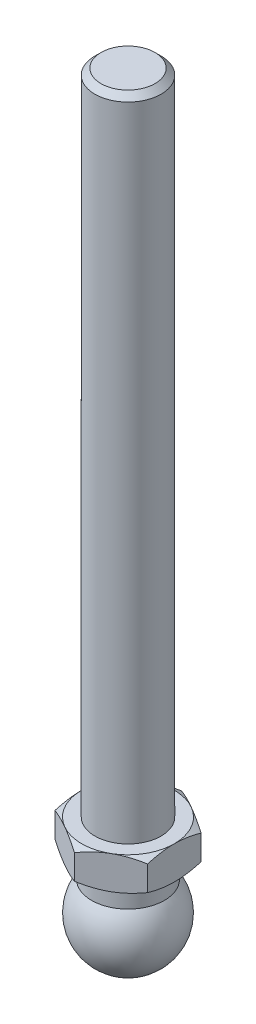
ISO-10303-21;
HEADER;
FILE_DESCRIPTION(('STEP AP214'),'2;1');
FILE_NAME('part.step','',(''),(''),'','','');
FILE_SCHEMA(('AUTOMOTIVE_DESIGN { 1 0 10303 214 1 1 1 1 }'));
ENDSEC;
DATA;
#1=APPLICATION_CONTEXT('core data for automotive mechanical design processes');
#2=APPLICATION_PROTOCOL_DEFINITION('international standard','automotive_design',2000,#1);
#3=PRODUCT_CONTEXT('',#1,'mechanical');
#4=PRODUCT('Part','Part','',(#3));
#5=PRODUCT_RELATED_PRODUCT_CATEGORY('part','',(#4));
#6=PRODUCT_DEFINITION_FORMATION('','',#4);
#7=PRODUCT_DEFINITION_CONTEXT('part definition',#1,'design');
#8=PRODUCT_DEFINITION('design','',#6,#7);
#9=PRODUCT_DEFINITION_SHAPE('','',#8);
#10=(LENGTH_UNIT() NAMED_UNIT(*) SI_UNIT(.MILLI.,.METRE.));
#11=(NAMED_UNIT(*) PLANE_ANGLE_UNIT() SI_UNIT($,.RADIAN.));
#12=(NAMED_UNIT(*) SI_UNIT($,.STERADIAN.) SOLID_ANGLE_UNIT());
#13=UNCERTAINTY_MEASURE_WITH_UNIT(LENGTH_MEASURE(1.E-05),#10,'distance_accuracy_value','');
#14=(GEOMETRIC_REPRESENTATION_CONTEXT(3) GLOBAL_UNCERTAINTY_ASSIGNED_CONTEXT((#13)) GLOBAL_UNIT_ASSIGNED_CONTEXT((#10,
#11,#12)) REPRESENTATION_CONTEXT('',''));
#15=CARTESIAN_POINT('',(0.,0.,0.));
#16=DIRECTION('',(0.,0.,1.));
#17=DIRECTION('',(1.,0.,0.));
#18=AXIS2_PLACEMENT_3D('',#15,#16,#17);
#19=CARTESIAN_POINT('',(0.,19.5,0.));
#20=DIRECTION('',(0.,-1.,0.));
#21=DIRECTION('',(0.,0.,-1.));
#22=AXIS2_PLACEMENT_3D('',#19,#20,#21);
#23=CONICAL_SURFACE('',#22,7.,1.0471975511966);
#24=CARTESIAN_POINT('',(-7.,15.2688336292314,12.5023453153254));
#25=CARTESIAN_POINT('',(-7.,15.4184696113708,12.2052647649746));
#26=CARTESIAN_POINT('',(-7.,15.5671267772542,11.9076861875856));
#27=CARTESIAN_POINT('',(-7.,15.8620076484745,11.3113035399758));
#28=CARTESIAN_POINT('',(-7.,16.0082312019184,11.0124993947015));
#29=CARTESIAN_POINT('',(-7.,16.2980281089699,10.4128982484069));
#30=CARTESIAN_POINT('',(-7.,16.441595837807,10.1120985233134));
#31=CARTESIAN_POINT('',(-7.,16.7251296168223,9.50881013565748));
#32=CARTESIAN_POINT('',(-7.,16.8650957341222,9.20632150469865));
#33=CARTESIAN_POINT('',(-7.,17.1470427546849,8.58510325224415));
#34=CARTESIAN_POINT('',(-7.,17.2888108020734,8.26627671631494));
#35=CARTESIAN_POINT('',(-7.,17.5662200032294,7.62594250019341));
#36=CARTESIAN_POINT('',(-7.,17.7018608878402,7.30443470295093));
#37=CARTESIAN_POINT('',(-7.,17.9652496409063,6.65840905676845));
#38=CARTESIAN_POINT('',(-7.,18.0930022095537,6.33389313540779));
#39=CARTESIAN_POINT('',(-7.,18.3384540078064,5.68109770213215));
#40=CARTESIAN_POINT('',(-7.,18.4561543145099,5.35281859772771));
#41=CARTESIAN_POINT('',(-7.,18.7028165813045,4.61998548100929));
#42=CARTESIAN_POINT('',(-7.,18.8286623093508,4.21436746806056));
#43=CARTESIAN_POINT('',(-7.,19.0543524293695,3.39574912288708));
#44=CARTESIAN_POINT('',(-7.,19.1541980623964,2.98274914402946));
#45=CARTESIAN_POINT('',(-7.,19.2776062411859,2.36178861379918));
#46=CARTESIAN_POINT('',(-7.,19.3141378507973,2.15638627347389));
#47=CARTESIAN_POINT('',(-7.,19.3780104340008,1.74416917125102));
#48=CARTESIAN_POINT('',(-7.,19.4053527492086,1.53735462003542));
#49=CARTESIAN_POINT('',(-7.,19.4500375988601,1.1227076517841));
#50=CARTESIAN_POINT('',(-7.,19.467383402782,0.914875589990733));
#51=CARTESIAN_POINT('',(-7.,19.4915250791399,0.498594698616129));
#52=CARTESIAN_POINT('',(-7.,19.4983210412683,0.290145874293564));
#53=CARTESIAN_POINT('',(-7.,19.5011397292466,-0.128421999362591));
#54=CARTESIAN_POINT('',(-7.,19.4970795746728,-0.338541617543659));
#55=CARTESIAN_POINT('',(-7.,19.4781521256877,-0.758289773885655));
#56=CARTESIAN_POINT('',(-7.,19.463284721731,-0.967918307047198));
#57=CARTESIAN_POINT('',(-7.,19.4232345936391,-1.38625975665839));
#58=CARTESIAN_POINT('',(-7.,19.3980479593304,-1.59497229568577));
#59=CARTESIAN_POINT('',(-7.,19.3381380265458,-2.01100790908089));
#60=CARTESIAN_POINT('',(-7.,19.3034145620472,-2.21833095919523));
#61=CARTESIAN_POINT('',(-7.,19.1849408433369,-2.84522045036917));
#62=CARTESIAN_POINT('',(-7.,19.0876569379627,-3.26225118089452));
#63=CARTESIAN_POINT('',(-7.,18.8658468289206,-4.08879182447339));
#64=CARTESIAN_POINT('',(-7.,18.7413180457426,-4.4983010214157));
#65=CARTESIAN_POINT('',(-7.,18.4953846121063,-5.2406101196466));
#66=CARTESIAN_POINT('',(-7.,18.3771372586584,-5.5744719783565));
#67=CARTESIAN_POINT('',(-7.,18.1300009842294,-6.23825206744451));
#68=CARTESIAN_POINT('',(-7.,18.0011107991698,-6.56816982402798));
#69=CARTESIAN_POINT('',(-7.,17.7350197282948,-7.22486424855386));
#70=CARTESIAN_POINT('',(-7.,17.5978135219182,-7.55163874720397));
#71=CARTESIAN_POINT('',(-7.,17.3169731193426,-8.20238370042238));
#72=CARTESIAN_POINT('',(-7.,17.1733392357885,-8.5263542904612));
#73=CARTESIAN_POINT('',(-7.,16.8876445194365,-9.15729037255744));
#74=CARTESIAN_POINT('',(-7.,16.7458097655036,-9.46435857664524));
#75=CARTESIAN_POINT('',(-7.,16.4583976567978,-10.0767426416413));
#76=CARTESIAN_POINT('',(-7.,16.3128202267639,-10.3820584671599));
#77=CARTESIAN_POINT('',(-7.,16.018926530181,-10.990585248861));
#78=CARTESIAN_POINT('',(-7.,15.8706165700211,-11.2937992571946));
#79=CARTESIAN_POINT('',(-7.,15.5714843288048,-11.8989613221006));
#80=CARTESIAN_POINT('',(-7.,15.4206622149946,-12.2009094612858));
#81=CARTESIAN_POINT('',(-7.,15.2688336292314,-12.5023453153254));
#82=B_SPLINE_CURVE_WITH_KNOTS('',3,(#24,#25,#26,#27,#28,#29,#30,#31,#32,#33,#34,#35,#36,#37,#38,
#39,#40,#41,#42,#43,#44,#45,#46,#47,#48,#49,#50,#51,#52,#53,#54,#55,#56,#57,#58,#59,#60,#61,#62,
#63,#64,#65,#66,#67,#68,#69,#70,#71,#72,#73,#74,#75,#76,#77,#78,#79,#80,#81),.UNSPECIFIED.,.F.,
.F.,(4,2,2,2,2,2,2,2,2,2,2,2,2,2,2,2,2,2,2,2,2,2,2,2,2,2,2,2,4),(0.,0.997917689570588,
1.99589743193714,2.99579247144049,3.99566886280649,5.04239250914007,6.08916209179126,
7.13530182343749,8.18132932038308,9.45480706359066,10.7282240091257,11.3539282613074,
11.9795411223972,12.6049492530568,13.2303520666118,13.8605430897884,14.490740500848,
15.1211769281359,15.7516243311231,17.0349275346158,18.3183522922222,19.380686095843,
20.4431462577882,21.506293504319,22.5693890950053,23.5840866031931,24.5988045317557,
25.6114179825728,26.6239642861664),.UNSPECIFIED.);
#83=CARTESIAN_POINT('',(-7.,18.8747852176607,4.04145188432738));
#84=VERTEX_POINT('',#83);
#85=CARTESIAN_POINT('',(-7.,19.5,0.));
#86=VERTEX_POINT('',#85);
#87=EDGE_CURVE('E358',#84,#86,#82,.T.);
#88=ORIENTED_EDGE('',*,*,#87,.F.);
#89=CARTESIAN_POINT('',(0.0002,18.8747185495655,8.0830192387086));
#90=CARTESIAN_POINT('',(-0.153667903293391,18.9260001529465,7.99418356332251));
#91=CARTESIAN_POINT('',(-0.30810950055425,18.9749544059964,7.90501666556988));
#92=CARTESIAN_POINT('',(-0.618246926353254,19.0675672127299,7.72595873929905));
#93=CARTESIAN_POINT('',(-0.773943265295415,19.1112234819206,7.63606741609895));
#94=CARTESIAN_POINT('',(-1.24352516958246,19.2333884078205,7.36495417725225));
#95=CARTESIAN_POINT('',(-1.5592643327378,19.302874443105,7.18266208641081));
#96=CARTESIAN_POINT('',(-2.03176224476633,19.3843550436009,6.9098652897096));
#97=CARTESIAN_POINT('',(-2.18710922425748,19.4075665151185,6.82017566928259));
#98=CARTESIAN_POINT('',(-2.49850511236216,19.4464887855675,6.64039116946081));
#99=CARTESIAN_POINT('',(-2.65455395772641,19.4622002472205,6.55029632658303));
#100=CARTESIAN_POINT('',(-2.96692267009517,19.4857220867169,6.36995016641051));
#101=CARTESIAN_POINT('',(-3.12324202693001,19.4935414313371,6.27969914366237));
#102=CARTESIAN_POINT('',(-3.43601650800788,19.5011197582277,6.09911871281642));
#103=CARTESIAN_POINT('',(-3.59247162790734,19.500878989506,6.00878930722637));
#104=CARTESIAN_POINT('',(-4.02110687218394,19.4891402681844,5.76131663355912));
#105=CARTESIAN_POINT('',(-4.2931466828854,19.4694342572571,5.60425437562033));
#106=CARTESIAN_POINT('',(-4.83541944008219,19.4069465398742,5.29117305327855));
#107=CARTESIAN_POINT('',(-5.10565047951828,19.364143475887,5.13515508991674));
#108=CARTESIAN_POINT('',(-5.64901454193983,19.2571483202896,4.82144370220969));
#109=CARTESIAN_POINT('',(-5.92207900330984,19.1925029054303,4.66378986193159));
#110=CARTESIAN_POINT('',(-6.46413578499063,19.045783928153,4.35083323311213));
#111=CARTESIAN_POINT('',(-6.73313504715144,18.9637448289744,4.19552643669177));
#112=CARTESIAN_POINT('',(-7.0002,18.8747185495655,4.04133641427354));
#113=B_SPLINE_CURVE_WITH_KNOTS('',3,(#89,#90,#91,#92,#93,#94,#95,#96,#97,#98,#99,#100,#101,#102,
#103,#104,#105,#106,#107,#108,#109,#110,#111,#112),.UNSPECIFIED.,.F.,.F.,(4,2,2,2,2,2,2,2,2,2,2,
4),(0.,0.554727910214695,1.10969417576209,2.2219327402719,2.76443041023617,3.30688013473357,
3.8487128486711,4.39052882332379,5.33376515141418,6.27787517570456,7.2429241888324,
8.20607866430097),.UNSPECIFIED.);
#114=CARTESIAN_POINT('',(-3.5,19.5,6.06217782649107));
#115=VERTEX_POINT('',#114);
#116=EDGE_CURVE('E147',#115,#84,#113,.T.);
#117=ORIENTED_EDGE('',*,*,#116,.F.);
#118=CARTESIAN_POINT('',(0.,19.5,0.));
#119=DIRECTION('',(0.,-1.,0.));
#120=DIRECTION('',(0.,0.,-1.));
#121=AXIS2_PLACEMENT_3D('',#118,#119,#120);
#122=CIRCLE('',#121,7.);
#123=EDGE_CURVE('E316',#115,#86,#122,.T.);
#124=ORIENTED_EDGE('',*,*,#123,.T.);
#125=EDGE_LOOP('',(#88,#117,#124));
#126=FACE_BOUND('',#125,.T.);
#127=ADVANCED_FACE('F17',(#126),#23,.T.);
#128=CARTESIAN_POINT('',(-7.,18.8747852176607,-4.04145188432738));
#129=VERTEX_POINT('',#128);
#130=EDGE_CURVE('E212',#86,#129,#82,.T.);
#131=ORIENTED_EDGE('',*,*,#130,.F.);
#132=CARTESIAN_POINT('',(-3.5,19.5,-6.06217782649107));
#133=VERTEX_POINT('',#132);
#134=EDGE_CURVE('E339',#86,#133,#122,.T.);
#135=ORIENTED_EDGE('',*,*,#134,.T.);
#136=CARTESIAN_POINT('',(-7.0002,18.8747185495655,-4.04133641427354));
#137=CARTESIAN_POINT('',(-6.84633209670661,18.9260001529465,-4.13017208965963));
#138=CARTESIAN_POINT('',(-6.69189049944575,18.9749544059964,-4.21933898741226));
#139=CARTESIAN_POINT('',(-6.38175307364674,19.0675672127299,-4.39839691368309));
#140=CARTESIAN_POINT('',(-6.22605673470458,19.1112234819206,-4.48828823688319));
#141=CARTESIAN_POINT('',(-5.75647483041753,19.2333884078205,-4.75940147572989));
#142=CARTESIAN_POINT('',(-5.4407356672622,19.302874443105,-4.94169356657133));
#143=CARTESIAN_POINT('',(-4.96823775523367,19.3843550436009,-5.21449036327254));
#144=CARTESIAN_POINT('',(-4.81289077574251,19.4075665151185,-5.30417998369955));
#145=CARTESIAN_POINT('',(-4.50149488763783,19.4464887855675,-5.48396448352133));
#146=CARTESIAN_POINT('',(-4.34544604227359,19.4622002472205,-5.57405932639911));
#147=CARTESIAN_POINT('',(-4.03307732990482,19.4857220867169,-5.75440548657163));
#148=CARTESIAN_POINT('',(-3.87675797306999,19.4935414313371,-5.84465650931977));
#149=CARTESIAN_POINT('',(-3.56398349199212,19.5011197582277,-6.02523694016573));
#150=CARTESIAN_POINT('',(-3.40752837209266,19.500878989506,-6.11556634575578));
#151=CARTESIAN_POINT('',(-2.97889312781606,19.4891402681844,-6.36303901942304));
#152=CARTESIAN_POINT('',(-2.7068533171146,19.4694342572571,-6.52010127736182));
#153=CARTESIAN_POINT('',(-2.1645805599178,19.4069465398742,-6.83318259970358));
#154=CARTESIAN_POINT('',(-1.89434952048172,19.364143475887,-6.9892005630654));
#155=CARTESIAN_POINT('',(-1.35098545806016,19.2571483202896,-7.30291195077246));
#156=CARTESIAN_POINT('',(-1.07792099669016,19.1925029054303,-7.46056579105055));
#157=CARTESIAN_POINT('',(-0.53586421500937,19.045783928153,-7.77352241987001));
#158=CARTESIAN_POINT('',(-0.26686495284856,18.9637448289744,-7.92882921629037));
#159=CARTESIAN_POINT('',(0.000200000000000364,18.8747185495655,-8.0830192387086));
#160=B_SPLINE_CURVE_WITH_KNOTS('',3,(#136,#137,#138,#139,#140,#141,#142,#143,#144,#145,#146,
#147,#148,#149,#150,#151,#152,#153,#154,#155,#156,#157,#158,#159),.UNSPECIFIED.,.F.,.F.,(4,2,2,
2,2,2,2,2,2,2,2,4),(0.,0.554727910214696,1.10969417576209,2.2219327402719,2.76443041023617,
3.30688013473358,3.8487128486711,4.39052882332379,5.33376515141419,6.27787517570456,
7.2429241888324,8.20607866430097),.UNSPECIFIED.);
#161=EDGE_CURVE('E204',#129,#133,#160,.T.);
#162=ORIENTED_EDGE('',*,*,#161,.F.);
#163=EDGE_LOOP('',(#131,#135,#162));
#164=FACE_BOUND('',#163,.T.);
#165=ADVANCED_FACE('F405',(#164),#23,.T.);
#166=CARTESIAN_POINT('',(0.,18.8747852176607,-8.08290376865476));
#167=VERTEX_POINT('',#166);
#168=EDGE_CURVE('E205',#133,#167,#160,.T.);
#169=ORIENTED_EDGE('',*,*,#168,.F.);
#170=CARTESIAN_POINT('',(3.5,19.5,-6.06217782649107));
#171=VERTEX_POINT('',#170);
#172=EDGE_CURVE('E330',#133,#171,#122,.T.);
#173=ORIENTED_EDGE('',*,*,#172,.T.);
#174=CARTESIAN_POINT('',(-0.0002,18.8747185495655,-8.0830192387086));
#175=CARTESIAN_POINT('',(0.153667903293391,18.9260001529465,-7.99418356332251));
#176=CARTESIAN_POINT('',(0.30810950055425,18.9749544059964,-7.90501666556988));
#177=CARTESIAN_POINT('',(0.618246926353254,19.0675672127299,-7.72595873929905));
#178=CARTESIAN_POINT('',(0.773943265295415,19.1112234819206,-7.63606741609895));
#179=CARTESIAN_POINT('',(1.24352516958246,19.2333884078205,-7.36495417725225));
#180=CARTESIAN_POINT('',(1.5592643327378,19.302874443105,-7.18266208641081));
#181=CARTESIAN_POINT('',(2.03176224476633,19.3843550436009,-6.9098652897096));
#182=CARTESIAN_POINT('',(2.18710922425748,19.4075665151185,-6.82017566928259));
#183=CARTESIAN_POINT('',(2.49850511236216,19.4464887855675,-6.64039116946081));
#184=CARTESIAN_POINT('',(2.65455395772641,19.4622002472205,-6.55029632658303));
#185=CARTESIAN_POINT('',(2.96692267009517,19.4857220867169,-6.36995016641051));
#186=CARTESIAN_POINT('',(3.12324202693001,19.4935414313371,-6.27969914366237));
#187=CARTESIAN_POINT('',(3.43601650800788,19.5011197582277,-6.09911871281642));
#188=CARTESIAN_POINT('',(3.59247162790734,19.500878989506,-6.00878930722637));
#189=CARTESIAN_POINT('',(4.02110687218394,19.4891402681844,-5.76131663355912));
#190=CARTESIAN_POINT('',(4.2931466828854,19.4694342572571,-5.60425437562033));
#191=CARTESIAN_POINT('',(4.83541944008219,19.4069465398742,-5.29117305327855));
#192=CARTESIAN_POINT('',(5.10565047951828,19.364143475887,-5.13515508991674));
#193=CARTESIAN_POINT('',(5.64901454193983,19.2571483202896,-4.82144370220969));
#194=CARTESIAN_POINT('',(5.92207900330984,19.1925029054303,-4.66378986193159));
#195=CARTESIAN_POINT('',(6.46413578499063,19.045783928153,-4.35083323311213));
#196=CARTESIAN_POINT('',(6.73313504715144,18.9637448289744,-4.19552643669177));
#197=CARTESIAN_POINT('',(7.0002,18.8747185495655,-4.04133641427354));
#198=B_SPLINE_CURVE_WITH_KNOTS('',3,(#174,#175,#176,#177,#178,#179,#180,#181,#182,#183,#184,
#185,#186,#187,#188,#189,#190,#191,#192,#193,#194,#195,#196,#197),.UNSPECIFIED.,.F.,.F.,(4,2,2,
2,2,2,2,2,2,2,2,4),(0.,0.554727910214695,1.10969417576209,2.2219327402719,2.76443041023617,
3.30688013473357,3.8487128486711,4.39052882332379,5.33376515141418,6.27787517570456,
7.2429241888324,8.20607866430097),.UNSPECIFIED.);
#199=EDGE_CURVE('E246',#167,#171,#198,.T.);
#200=ORIENTED_EDGE('',*,*,#199,.F.);
#201=EDGE_LOOP('',(#169,#173,#200));
#202=FACE_BOUND('',#201,.T.);
#203=ADVANCED_FACE('F411',(#202),#23,.T.);
#204=CARTESIAN_POINT('',(7.,18.8747852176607,-4.04145188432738));
#205=VERTEX_POINT('',#204);
#206=EDGE_CURVE('E247',#171,#205,#198,.T.);
#207=ORIENTED_EDGE('',*,*,#206,.F.);
#208=CARTESIAN_POINT('',(7.,19.5,0.));
#209=VERTEX_POINT('',#208);
#210=EDGE_CURVE('E323',#171,#209,#122,.T.);
#211=ORIENTED_EDGE('',*,*,#210,.T.);
#212=CARTESIAN_POINT('',(7.,15.2688336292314,-12.5023453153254));
#213=CARTESIAN_POINT('',(7.,15.4184696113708,-12.2052647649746));
#214=CARTESIAN_POINT('',(7.,15.5671267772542,-11.9076861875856));
#215=CARTESIAN_POINT('',(7.,15.8620076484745,-11.3113035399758));
#216=CARTESIAN_POINT('',(7.,16.0082312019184,-11.0124993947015));
#217=CARTESIAN_POINT('',(7.,16.2980281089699,-10.4128982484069));
#218=CARTESIAN_POINT('',(7.,16.441595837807,-10.1120985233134));
#219=CARTESIAN_POINT('',(7.,16.7251296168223,-9.50881013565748));
#220=CARTESIAN_POINT('',(7.,16.8650957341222,-9.20632150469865));
#221=CARTESIAN_POINT('',(7.,17.1470427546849,-8.58510325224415));
#222=CARTESIAN_POINT('',(7.,17.2888108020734,-8.26627671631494));
#223=CARTESIAN_POINT('',(7.,17.5662200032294,-7.62594250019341));
#224=CARTESIAN_POINT('',(7.,17.7018608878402,-7.30443470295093));
#225=CARTESIAN_POINT('',(7.,17.9652496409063,-6.65840905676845));
#226=CARTESIAN_POINT('',(7.,18.0930022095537,-6.33389313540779));
#227=CARTESIAN_POINT('',(7.,18.3384540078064,-5.68109770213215));
#228=CARTESIAN_POINT('',(7.,18.4561543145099,-5.35281859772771));
#229=CARTESIAN_POINT('',(7.,18.7028165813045,-4.61998548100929));
#230=CARTESIAN_POINT('',(7.,18.8286623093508,-4.21436746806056));
#231=CARTESIAN_POINT('',(7.,19.0543524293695,-3.39574912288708));
#232=CARTESIAN_POINT('',(7.,19.1541980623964,-2.98274914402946));
#233=CARTESIAN_POINT('',(7.,19.2776062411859,-2.36178861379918));
#234=CARTESIAN_POINT('',(7.,19.3141378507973,-2.15638627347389));
#235=CARTESIAN_POINT('',(7.,19.3780104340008,-1.74416917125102));
#236=CARTESIAN_POINT('',(7.,19.4053527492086,-1.53735462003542));
#237=CARTESIAN_POINT('',(7.,19.4500375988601,-1.1227076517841));
#238=CARTESIAN_POINT('',(7.,19.467383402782,-0.914875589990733));
#239=CARTESIAN_POINT('',(7.,19.4915250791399,-0.498594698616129));
#240=CARTESIAN_POINT('',(7.,19.4983210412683,-0.290145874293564));
#241=CARTESIAN_POINT('',(7.,19.5011397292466,0.128421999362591));
#242=CARTESIAN_POINT('',(7.,19.4970795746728,0.338541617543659));
#243=CARTESIAN_POINT('',(7.,19.4781521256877,0.758289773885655));
#244=CARTESIAN_POINT('',(7.,19.463284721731,0.967918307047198));
#245=CARTESIAN_POINT('',(7.,19.4232345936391,1.38625975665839));
#246=CARTESIAN_POINT('',(7.,19.3980479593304,1.59497229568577));
#247=CARTESIAN_POINT('',(7.,19.3381380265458,2.01100790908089));
#248=CARTESIAN_POINT('',(7.,19.3034145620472,2.21833095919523));
#249=CARTESIAN_POINT('',(7.,19.1849408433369,2.84522045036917));
#250=CARTESIAN_POINT('',(7.,19.0876569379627,3.26225118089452));
#251=CARTESIAN_POINT('',(7.,18.8658468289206,4.08879182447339));
#252=CARTESIAN_POINT('',(7.,18.7413180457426,4.4983010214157));
#253=CARTESIAN_POINT('',(7.,18.4953846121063,5.2406101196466));
#254=CARTESIAN_POINT('',(7.,18.3771372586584,5.5744719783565));
#255=CARTESIAN_POINT('',(7.,18.1300009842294,6.23825206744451));
#256=CARTESIAN_POINT('',(7.,18.0011107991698,6.56816982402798));
#257=CARTESIAN_POINT('',(7.,17.7350197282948,7.22486424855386));
#258=CARTESIAN_POINT('',(7.,17.5978135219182,7.55163874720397));
#259=CARTESIAN_POINT('',(7.,17.3169731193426,8.20238370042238));
#260=CARTESIAN_POINT('',(7.,17.1733392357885,8.5263542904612));
#261=CARTESIAN_POINT('',(7.,16.8876445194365,9.15729037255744));
#262=CARTESIAN_POINT('',(7.,16.7458097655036,9.46435857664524));
#263=CARTESIAN_POINT('',(7.,16.4583976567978,10.0767426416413));
#264=CARTESIAN_POINT('',(7.,16.3128202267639,10.3820584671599));
#265=CARTESIAN_POINT('',(7.,16.018926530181,10.990585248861));
#266=CARTESIAN_POINT('',(7.,15.8706165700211,11.2937992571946));
#267=CARTESIAN_POINT('',(7.,15.5714843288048,11.8989613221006));
#268=CARTESIAN_POINT('',(7.,15.4206622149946,12.2009094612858));
#269=CARTESIAN_POINT('',(7.,15.2688336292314,12.5023453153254));
#270=B_SPLINE_CURVE_WITH_KNOTS('',3,(#212,#213,#214,#215,#216,#217,#218,#219,#220,#221,#222,
#223,#224,#225,#226,#227,#228,#229,#230,#231,#232,#233,#234,#235,#236,#237,#238,#239,#240,#241,
#242,#243,#244,#245,#246,#247,#248,#249,#250,#251,#252,#253,#254,#255,#256,#257,#258,#259,#260,
#261,#262,#263,#264,#265,#266,#267,#268,#269),.UNSPECIFIED.,.F.,.F.,(4,2,2,2,2,2,2,2,2,2,2,2,2,
2,2,2,2,2,2,2,2,2,2,2,2,2,2,2,4),(0.,0.997917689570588,1.99589743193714,2.99579247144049,
3.99566886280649,5.04239250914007,6.08916209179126,7.13530182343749,8.18132932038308,
9.45480706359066,10.7282240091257,11.3539282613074,11.9795411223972,12.6049492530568,
13.2303520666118,13.8605430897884,14.490740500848,15.1211769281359,15.7516243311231,
17.0349275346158,18.3183522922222,19.380686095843,20.4431462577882,21.506293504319,
22.5693890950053,23.5840866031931,24.5988045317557,25.6114179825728,26.6239642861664),.UNSPECIFIED.);
#271=EDGE_CURVE('E269',#205,#209,#270,.T.);
#272=ORIENTED_EDGE('',*,*,#271,.F.);
#273=EDGE_LOOP('',(#207,#211,#272));
#274=FACE_BOUND('',#273,.T.);
#275=ADVANCED_FACE('F421',(#274),#23,.T.);
#276=CARTESIAN_POINT('',(7.,18.8747852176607,4.04145188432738));
#277=VERTEX_POINT('',#276);
#278=EDGE_CURVE('E270',#209,#277,#270,.T.);
#279=ORIENTED_EDGE('',*,*,#278,.F.);
#280=CARTESIAN_POINT('',(3.5,19.5,6.06217782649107));
#281=VERTEX_POINT('',#280);
#282=EDGE_CURVE('E313',#209,#281,#122,.T.);
#283=ORIENTED_EDGE('',*,*,#282,.T.);
#284=CARTESIAN_POINT('',(7.0002,18.8747185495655,4.04133641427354));
#285=CARTESIAN_POINT('',(6.84633209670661,18.9260001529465,4.13017208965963));
#286=CARTESIAN_POINT('',(6.69189049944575,18.9749544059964,4.21933898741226));
#287=CARTESIAN_POINT('',(6.38175307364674,19.0675672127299,4.39839691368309));
#288=CARTESIAN_POINT('',(6.22605673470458,19.1112234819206,4.48828823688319));
#289=CARTESIAN_POINT('',(5.75647483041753,19.2333884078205,4.75940147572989));
#290=CARTESIAN_POINT('',(5.4407356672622,19.302874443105,4.94169356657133));
#291=CARTESIAN_POINT('',(4.96823775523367,19.3843550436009,5.21449036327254));
#292=CARTESIAN_POINT('',(4.81289077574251,19.4075665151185,5.30417998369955));
#293=CARTESIAN_POINT('',(4.50149488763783,19.4464887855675,5.48396448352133));
#294=CARTESIAN_POINT('',(4.34544604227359,19.4622002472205,5.57405932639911));
#295=CARTESIAN_POINT('',(4.03307732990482,19.4857220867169,5.75440548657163));
#296=CARTESIAN_POINT('',(3.87675797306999,19.4935414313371,5.84465650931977));
#297=CARTESIAN_POINT('',(3.56398349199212,19.5011197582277,6.02523694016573));
#298=CARTESIAN_POINT('',(3.40752837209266,19.500878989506,6.11556634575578));
#299=CARTESIAN_POINT('',(2.97889312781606,19.4891402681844,6.36303901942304));
#300=CARTESIAN_POINT('',(2.7068533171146,19.4694342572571,6.52010127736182));
#301=CARTESIAN_POINT('',(2.1645805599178,19.4069465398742,6.83318259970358));
#302=CARTESIAN_POINT('',(1.89434952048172,19.364143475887,6.9892005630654));
#303=CARTESIAN_POINT('',(1.35098545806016,19.2571483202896,7.30291195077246));
#304=CARTESIAN_POINT('',(1.07792099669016,19.1925029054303,7.46056579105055));
#305=CARTESIAN_POINT('',(0.53586421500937,19.045783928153,7.77352241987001));
#306=CARTESIAN_POINT('',(0.26686495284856,18.9637448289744,7.92882921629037));
#307=CARTESIAN_POINT('',(-0.000200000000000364,18.8747185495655,8.0830192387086));
#308=B_SPLINE_CURVE_WITH_KNOTS('',3,(#284,#285,#286,#287,#288,#289,#290,#291,#292,#293,#294,
#295,#296,#297,#298,#299,#300,#301,#302,#303,#304,#305,#306,#307),.UNSPECIFIED.,.F.,.F.,(4,2,2,
2,2,2,2,2,2,2,2,4),(0.,0.554727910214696,1.10969417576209,2.2219327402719,2.76443041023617,
3.30688013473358,3.8487128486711,4.39052882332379,5.33376515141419,6.27787517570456,
7.2429241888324,8.20607866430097),.UNSPECIFIED.);
#309=EDGE_CURVE('E137',#277,#281,#308,.T.);
#310=ORIENTED_EDGE('',*,*,#309,.F.);
#311=EDGE_LOOP('',(#279,#283,#310));
#312=FACE_BOUND('',#311,.T.);
#313=ADVANCED_FACE('F319',(#312),#23,.T.);
#314=CARTESIAN_POINT('',(0.,18.8747852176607,8.08290376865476));
#315=VERTEX_POINT('',#314);
#316=EDGE_CURVE('E121',#281,#315,#308,.T.);
#317=ORIENTED_EDGE('',*,*,#316,.F.);
#318=EDGE_CURVE('E308',#281,#115,#122,.T.);
#319=ORIENTED_EDGE('',*,*,#318,.T.);
#320=EDGE_CURVE('E33',#315,#115,#113,.T.);
#321=ORIENTED_EDGE('',*,*,#320,.F.);
#322=EDGE_LOOP('',(#317,#319,#321));
#323=FACE_BOUND('',#322,.T.);
#324=ADVANCED_FACE('F307',(#323),#23,.T.);
#325=CARTESIAN_POINT('',(5.,19.5,0.));
#326=DIRECTION('',(0.,-1.,0.));
#327=DIRECTION('',(0.,0.,-1.));
#328=AXIS2_PLACEMENT_3D('',#325,#326,#327);
#329=PLANE('',#328);
#330=CARTESIAN_POINT('',(0.,19.5,0.));
#331=DIRECTION('',(0.,-1.,0.));
#332=DIRECTION('',(0.,0.,-1.));
#333=AXIS2_PLACEMENT_3D('',#330,#331,#332);
#334=CIRCLE('',#333,5.);
#335=CARTESIAN_POINT('',(0.,19.5,-5.));
#336=VERTEX_POINT('',#335);
#337=EDGE_CURVE('E322',#336,#336,#334,.F.);
#338=ORIENTED_EDGE('',*,*,#337,.F.);
#339=EDGE_LOOP('',(#338));
#340=FACE_BOUND('',#339,.T.);
#341=ORIENTED_EDGE('',*,*,#282,.F.);
#342=ORIENTED_EDGE('',*,*,#210,.F.);
#343=ORIENTED_EDGE('',*,*,#172,.F.);
#344=ORIENTED_EDGE('',*,*,#134,.F.);
#345=ORIENTED_EDGE('',*,*,#123,.F.);
#346=ORIENTED_EDGE('',*,*,#318,.F.);
#347=EDGE_LOOP('',(#341,#342,#343,#344,#345,#346));
#348=FACE_BOUND('',#347,.T.);
#349=ADVANCED_FACE('F226',(#340,#348),#329,.F.);
#350=CARTESIAN_POINT('',(-7.,14.3,-4.04145188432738));
#351=DIRECTION('',(-1.,0.,0.));
#352=DIRECTION('',(0.,0.,1.));
#353=AXIS2_PLACEMENT_3D('',#350,#351,#352);
#354=PLANE('',#353);
#355=ORIENTED_EDGE('',*,*,#87,.T.);
#356=ORIENTED_EDGE('',*,*,#130,.T.);
#357=DIRECTION('',(0.,1.,0.));
#358=VECTOR('',#357,1.);
#359=CARTESIAN_POINT('',(-7.,14.3,-4.04145188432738));
#360=LINE('',#359,#358);
#361=CARTESIAN_POINT('',(-7.,15.1252147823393,-4.04145188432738));
#362=VERTEX_POINT('',#361);
#363=EDGE_CURVE('E114',#362,#129,#360,.T.);
#364=ORIENTED_EDGE('',*,*,#363,.F.);
#365=CARTESIAN_POINT('',(-7.,18.7311663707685,-12.5023453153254));
#366=CARTESIAN_POINT('',(-7.,18.5815303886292,-12.2052647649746));
#367=CARTESIAN_POINT('',(-7.,18.4328732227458,-11.9076861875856));
#368=CARTESIAN_POINT('',(-7.,18.1379923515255,-11.3113035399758));
#369=CARTESIAN_POINT('',(-7.,17.9917687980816,-11.0124993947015));
#370=CARTESIAN_POINT('',(-7.,17.7019718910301,-10.4128982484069));
#371=CARTESIAN_POINT('',(-7.,17.558404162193,-10.1120985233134));
#372=CARTESIAN_POINT('',(-7.,17.2748703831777,-9.50881013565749));
#373=CARTESIAN_POINT('',(-7.,17.1349042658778,-9.20632150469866));
#374=CARTESIAN_POINT('',(-7.,16.8529572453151,-8.58510325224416));
#375=CARTESIAN_POINT('',(-7.,16.7111891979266,-8.26627671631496));
#376=CARTESIAN_POINT('',(-7.,16.4337799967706,-7.62594250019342));
#377=CARTESIAN_POINT('',(-7.,16.2981391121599,-7.30443470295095));
#378=CARTESIAN_POINT('',(-7.,16.0347503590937,-6.65840905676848));
#379=CARTESIAN_POINT('',(-7.,15.9069977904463,-6.33389313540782));
#380=CARTESIAN_POINT('',(-7.,15.6615459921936,-5.68109770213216));
#381=CARTESIAN_POINT('',(-7.,15.5438456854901,-5.35281859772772));
#382=CARTESIAN_POINT('',(-7.,15.2971834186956,-4.6199854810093));
#383=CARTESIAN_POINT('',(-7.,15.1713376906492,-4.21436746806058));
#384=CARTESIAN_POINT('',(-7.,14.9456475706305,-3.39574912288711));
#385=CARTESIAN_POINT('',(-7.,14.8458019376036,-2.98274914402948));
#386=CARTESIAN_POINT('',(-7.,14.7223937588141,-2.3617886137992));
#387=CARTESIAN_POINT('',(-7.,14.6858621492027,-2.1563862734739));
#388=CARTESIAN_POINT('',(-7.,14.6219895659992,-1.74416917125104));
#389=CARTESIAN_POINT('',(-7.,14.5946472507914,-1.53735462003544));
#390=CARTESIAN_POINT('',(-7.,14.5499624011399,-1.12270765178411));
#391=CARTESIAN_POINT('',(-7.,14.532616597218,-0.914875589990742));
#392=CARTESIAN_POINT('',(-7.,14.5084749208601,-0.498594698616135));
#393=CARTESIAN_POINT('',(-7.,14.5016789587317,-0.290145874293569));
#394=CARTESIAN_POINT('',(-7.,14.4988602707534,0.128421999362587));
#395=CARTESIAN_POINT('',(-7.,14.5029204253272,0.338541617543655));
#396=CARTESIAN_POINT('',(-7.,14.5218478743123,0.758289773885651));
#397=CARTESIAN_POINT('',(-7.,14.5367152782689,0.967918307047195));
#398=CARTESIAN_POINT('',(-7.,14.5767654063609,1.38625975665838));
#399=CARTESIAN_POINT('',(-7.,14.6019520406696,1.59497229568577));
#400=CARTESIAN_POINT('',(-7.,14.6618619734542,2.01100790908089));
#401=CARTESIAN_POINT('',(-7.,14.6965854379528,2.21833095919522));
#402=CARTESIAN_POINT('',(-7.,14.8150591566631,2.84522045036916));
#403=CARTESIAN_POINT('',(-7.,14.9123430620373,3.26225118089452));
#404=CARTESIAN_POINT('',(-7.,15.1341531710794,4.08879182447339));
#405=CARTESIAN_POINT('',(-7.,15.2586819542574,4.4983010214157));
#406=CARTESIAN_POINT('',(-7.,15.5046153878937,5.2406101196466));
#407=CARTESIAN_POINT('',(-7.,15.6228627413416,5.5744719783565));
#408=CARTESIAN_POINT('',(-7.,15.8699990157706,6.23825206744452));
#409=CARTESIAN_POINT('',(-7.,15.9988892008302,6.56816982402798));
#410=CARTESIAN_POINT('',(-7.,16.2649802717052,7.22486424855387));
#411=CARTESIAN_POINT('',(-7.,16.4021864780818,7.55163874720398));
#412=CARTESIAN_POINT('',(-7.,16.6830268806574,8.20238370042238));
#413=CARTESIAN_POINT('',(-7.,16.8266607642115,8.5263542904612));
#414=CARTESIAN_POINT('',(-7.,17.1123554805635,9.15729037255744));
#415=CARTESIAN_POINT('',(-7.,17.2541902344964,9.46435857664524));
#416=CARTESIAN_POINT('',(-7.,17.5416023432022,10.0767426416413));
#417=CARTESIAN_POINT('',(-7.,17.6871797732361,10.38205846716));
#418=CARTESIAN_POINT('',(-7.,17.981073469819,10.990585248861));
#419=CARTESIAN_POINT('',(-7.,18.1293834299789,11.2937992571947));
#420=CARTESIAN_POINT('',(-7.,18.4285156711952,11.8989613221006));
#421=CARTESIAN_POINT('',(-7.,18.5793377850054,12.2009094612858));
#422=CARTESIAN_POINT('',(-7.,18.7311663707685,12.5023453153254));
#423=B_SPLINE_CURVE_WITH_KNOTS('',3,(#365,#366,#367,#368,#369,#370,#371,#372,#373,#374,#375,
#376,#377,#378,#379,#380,#381,#382,#383,#384,#385,#386,#387,#388,#389,#390,#391,#392,#393,#394,
#395,#396,#397,#398,#399,#400,#401,#402,#403,#404,#405,#406,#407,#408,#409,#410,#411,#412,#413,
#414,#415,#416,#417,#418,#419,#420,#421,#422),.UNSPECIFIED.,.F.,.F.,(4,2,2,2,2,2,2,2,2,2,2,2,2,
2,2,2,2,2,2,2,2,2,2,2,2,2,2,2,4),(0.,0.997917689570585,1.99589743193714,2.99579247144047,
3.99566886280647,5.04239250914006,6.08916209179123,7.13530182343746,8.18132932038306,
9.45480706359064,10.7282240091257,11.3539282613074,11.9795411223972,12.6049492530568,
13.2303520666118,13.8605430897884,14.490740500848,15.1211769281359,15.7516243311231,
17.0349275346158,18.3183522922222,19.380686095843,20.4431462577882,21.506293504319,
22.5693890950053,23.5840866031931,24.5988045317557,25.6114179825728,26.6239642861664),.UNSPECIFIED.);
#424=CARTESIAN_POINT('',(-7.,14.5,0.));
#425=VERTEX_POINT('',#424);
#426=EDGE_CURVE('E203',#362,#425,#423,.T.);
#427=ORIENTED_EDGE('',*,*,#426,.T.);
#428=CARTESIAN_POINT('',(-7.,15.1252147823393,4.04145188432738));
#429=VERTEX_POINT('',#428);
#430=EDGE_CURVE('E193',#425,#429,#423,.T.);
#431=ORIENTED_EDGE('',*,*,#430,.T.);
#432=DIRECTION('',(0.,1.,0.));
#433=VECTOR('',#432,1.);
#434=CARTESIAN_POINT('',(-7.,14.3,4.04145188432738));
#435=LINE('',#434,#433);
#436=EDGE_CURVE('E124',#429,#84,#435,.T.);
#437=ORIENTED_EDGE('',*,*,#436,.T.);
#438=EDGE_LOOP('',(#355,#356,#364,#427,#431,#437));
#439=FACE_BOUND('',#438,.T.);
#440=ADVANCED_FACE('F221',(#439),#354,.T.);
#441=CARTESIAN_POINT('',(0.,14.3,-8.08290376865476));
#442=DIRECTION('',(-0.5,0.,-0.866025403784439));
#443=DIRECTION('',(-0.866025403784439,0.,0.5));
#444=AXIS2_PLACEMENT_3D('',#441,#442,#443);
#445=PLANE('',#444);
#446=ORIENTED_EDGE('',*,*,#161,.T.);
#447=ORIENTED_EDGE('',*,*,#168,.T.);
#448=DIRECTION('',(0.,1.,0.));
#449=VECTOR('',#448,1.);
#450=CARTESIAN_POINT('',(0.,14.3,-8.08290376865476));
#451=LINE('',#450,#449);
#452=CARTESIAN_POINT('',(0.,15.1252147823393,-8.08290376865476));
#453=VERTEX_POINT('',#452);
#454=EDGE_CURVE('E445',#453,#167,#451,.T.);
#455=ORIENTED_EDGE('',*,*,#454,.F.);
#456=CARTESIAN_POINT('',(0.000200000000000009,15.1252814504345,-8.0830192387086));
#457=CARTESIAN_POINT('',(-0.153667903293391,15.0739998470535,-7.99418356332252));
#458=CARTESIAN_POINT('',(-0.30810950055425,15.0250455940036,-7.90501666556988));
#459=CARTESIAN_POINT('',(-0.618246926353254,14.9324327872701,-7.72595873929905));
#460=CARTESIAN_POINT('',(-0.773943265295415,14.8887765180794,-7.63606741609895));
#461=CARTESIAN_POINT('',(-1.24352516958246,14.7666115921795,-7.36495417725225));
#462=CARTESIAN_POINT('',(-1.5592643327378,14.697125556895,-7.18266208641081));
#463=CARTESIAN_POINT('',(-2.03176224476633,14.6156449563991,-6.9098652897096));
#464=CARTESIAN_POINT('',(-2.18710922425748,14.5924334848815,-6.82017566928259));
#465=CARTESIAN_POINT('',(-2.49850511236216,14.5535112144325,-6.64039116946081));
#466=CARTESIAN_POINT('',(-2.65455395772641,14.5377997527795,-6.55029632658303));
#467=CARTESIAN_POINT('',(-2.96692267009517,14.5142779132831,-6.36995016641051));
#468=CARTESIAN_POINT('',(-3.12324202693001,14.5064585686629,-6.27969914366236));
#469=CARTESIAN_POINT('',(-3.43601650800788,14.4988802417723,-6.09911871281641));
#470=CARTESIAN_POINT('',(-3.59247162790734,14.499121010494,-6.00878930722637));
#471=CARTESIAN_POINT('',(-4.02110687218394,14.5108597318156,-5.76131663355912));
#472=CARTESIAN_POINT('',(-4.2931466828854,14.5305657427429,-5.60425437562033));
#473=CARTESIAN_POINT('',(-4.8354194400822,14.5930534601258,-5.29117305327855));
#474=CARTESIAN_POINT('',(-5.10565047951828,14.635856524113,-5.13515508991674));
#475=CARTESIAN_POINT('',(-5.64901454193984,14.7428516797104,-4.82144370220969));
#476=CARTESIAN_POINT('',(-5.92207900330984,14.8074970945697,-4.66378986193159));
#477=CARTESIAN_POINT('',(-6.46413578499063,14.954216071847,-4.35083323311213));
#478=CARTESIAN_POINT('',(-6.73313504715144,15.0362551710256,-4.19552643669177));
#479=CARTESIAN_POINT('',(-7.0002,15.1252814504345,-4.04133641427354));
#480=B_SPLINE_CURVE_WITH_KNOTS('',3,(#456,#457,#458,#459,#460,#461,#462,#463,#464,#465,#466,
#467,#468,#469,#470,#471,#472,#473,#474,#475,#476,#477,#478,#479),.UNSPECIFIED.,.F.,.F.,(4,2,2,
2,2,2,2,2,2,2,2,4),(0.,0.554727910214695,1.10969417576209,2.2219327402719,2.76443041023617,
3.30688013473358,3.8487128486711,4.39052882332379,5.33376515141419,6.27787517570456,
7.2429241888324,8.20607866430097),.UNSPECIFIED.);
#481=CARTESIAN_POINT('',(-3.5,14.5,-6.06217782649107));
#482=VERTEX_POINT('',#481);
#483=EDGE_CURVE('E245',#453,#482,#480,.T.);
#484=ORIENTED_EDGE('',*,*,#483,.T.);
#485=EDGE_CURVE('E237',#482,#362,#480,.T.);
#486=ORIENTED_EDGE('',*,*,#485,.T.);
#487=ORIENTED_EDGE('',*,*,#363,.T.);
#488=EDGE_LOOP('',(#446,#447,#455,#484,#486,#487));
#489=FACE_BOUND('',#488,.T.);
#490=ADVANCED_FACE('F225',(#489),#445,.T.);
#491=CARTESIAN_POINT('',(7.,14.3,-4.04145188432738));
#492=DIRECTION('',(0.5,0.,-0.866025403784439));
#493=DIRECTION('',(-0.866025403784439,0.,-0.5));
#494=AXIS2_PLACEMENT_3D('',#491,#492,#493);
#495=PLANE('',#494);
#496=ORIENTED_EDGE('',*,*,#199,.T.);
#497=ORIENTED_EDGE('',*,*,#206,.T.);
#498=DIRECTION('',(0.,1.,0.));
#499=VECTOR('',#498,1.);
#500=CARTESIAN_POINT('',(7.,14.3,-4.04145188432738));
#501=LINE('',#500,#499);
#502=CARTESIAN_POINT('',(7.,15.1252147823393,-4.04145188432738));
#503=VERTEX_POINT('',#502);
#504=EDGE_CURVE('E462',#503,#205,#501,.T.);
#505=ORIENTED_EDGE('',*,*,#504,.F.);
#506=CARTESIAN_POINT('',(7.0002,15.1252814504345,-4.04133641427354));
#507=CARTESIAN_POINT('',(6.84633209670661,15.0739998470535,-4.13017208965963));
#508=CARTESIAN_POINT('',(6.69189049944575,15.0250455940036,-4.21933898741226));
#509=CARTESIAN_POINT('',(6.38175307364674,14.9324327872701,-4.39839691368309));
#510=CARTESIAN_POINT('',(6.22605673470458,14.8887765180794,-4.48828823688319));
#511=CARTESIAN_POINT('',(5.75647483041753,14.7666115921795,-4.75940147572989));
#512=CARTESIAN_POINT('',(5.4407356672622,14.697125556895,-4.94169356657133));
#513=CARTESIAN_POINT('',(4.96823775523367,14.6156449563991,-5.21449036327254));
#514=CARTESIAN_POINT('',(4.81289077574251,14.5924334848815,-5.30417998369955));
#515=CARTESIAN_POINT('',(4.50149488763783,14.5535112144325,-5.48396448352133));
#516=CARTESIAN_POINT('',(4.34544604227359,14.5377997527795,-5.57405932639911));
#517=CARTESIAN_POINT('',(4.03307732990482,14.5142779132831,-5.75440548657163));
#518=CARTESIAN_POINT('',(3.87675797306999,14.5064585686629,-5.84465650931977));
#519=CARTESIAN_POINT('',(3.56398349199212,14.4988802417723,-6.02523694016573));
#520=CARTESIAN_POINT('',(3.40752837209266,14.499121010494,-6.11556634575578));
#521=CARTESIAN_POINT('',(2.97889312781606,14.5108597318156,-6.36303901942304));
#522=CARTESIAN_POINT('',(2.7068533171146,14.5305657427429,-6.52010127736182));
#523=CARTESIAN_POINT('',(2.1645805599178,14.5930534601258,-6.83318259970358));
#524=CARTESIAN_POINT('',(1.89434952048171,14.635856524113,-6.9892005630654));
#525=CARTESIAN_POINT('',(1.35098545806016,14.7428516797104,-7.30291195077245));
#526=CARTESIAN_POINT('',(1.07792099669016,14.8074970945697,-7.46056579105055));
#527=CARTESIAN_POINT('',(0.53586421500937,14.954216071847,-7.77352241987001));
#528=CARTESIAN_POINT('',(0.266864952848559,15.0362551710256,-7.92882921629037));
#529=CARTESIAN_POINT('',(-0.000199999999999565,15.1252814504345,-8.0830192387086));
#530=B_SPLINE_CURVE_WITH_KNOTS('',3,(#506,#507,#508,#509,#510,#511,#512,#513,#514,#515,#516,
#517,#518,#519,#520,#521,#522,#523,#524,#525,#526,#527,#528,#529),.UNSPECIFIED.,.F.,.F.,(4,2,2,
2,2,2,2,2,2,2,2,4),(0.,0.554727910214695,1.10969417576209,2.2219327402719,2.76443041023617,
3.30688013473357,3.8487128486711,4.39052882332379,5.33376515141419,6.27787517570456,
7.2429241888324,8.20607866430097),.UNSPECIFIED.);
#531=CARTESIAN_POINT('',(3.5,14.5,-6.06217782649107));
#532=VERTEX_POINT('',#531);
#533=EDGE_CURVE('E268',#503,#532,#530,.T.);
#534=ORIENTED_EDGE('',*,*,#533,.T.);
#535=EDGE_CURVE('E260',#532,#453,#530,.T.);
#536=ORIENTED_EDGE('',*,*,#535,.T.);
#537=ORIENTED_EDGE('',*,*,#454,.T.);
#538=EDGE_LOOP('',(#496,#497,#505,#534,#536,#537));
#539=FACE_BOUND('',#538,.T.);
#540=ADVANCED_FACE('F233',(#539),#495,.T.);
#541=CARTESIAN_POINT('',(7.,14.3,4.04145188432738));
#542=DIRECTION('',(1.,0.,0.));
#543=DIRECTION('',(0.,0.,-1.));
#544=AXIS2_PLACEMENT_3D('',#541,#542,#543);
#545=PLANE('',#544);
#546=ORIENTED_EDGE('',*,*,#271,.T.);
#547=ORIENTED_EDGE('',*,*,#278,.T.);
#548=DIRECTION('',(0.,1.,0.));
#549=VECTOR('',#548,1.);
#550=CARTESIAN_POINT('',(7.,14.3,4.04145188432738));
#551=LINE('',#550,#549);
#552=CARTESIAN_POINT('',(7.,15.1252147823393,4.04145188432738));
#553=VERTEX_POINT('',#552);
#554=EDGE_CURVE('E123',#553,#277,#551,.T.);
#555=ORIENTED_EDGE('',*,*,#554,.F.);
#556=CARTESIAN_POINT('',(7.,18.7311663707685,12.5023453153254));
#557=CARTESIAN_POINT('',(7.,18.5815303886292,12.2052647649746));
#558=CARTESIAN_POINT('',(7.,18.4328732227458,11.9076861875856));
#559=CARTESIAN_POINT('',(7.,18.1379923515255,11.3113035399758));
#560=CARTESIAN_POINT('',(7.,17.9917687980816,11.0124993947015));
#561=CARTESIAN_POINT('',(7.,17.7019718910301,10.4128982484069));
#562=CARTESIAN_POINT('',(7.,17.558404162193,10.1120985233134));
#563=CARTESIAN_POINT('',(7.,17.2748703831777,9.50881013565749));
#564=CARTESIAN_POINT('',(7.,17.1349042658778,9.20632150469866));
#565=CARTESIAN_POINT('',(7.,16.8529572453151,8.58510325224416));
#566=CARTESIAN_POINT('',(7.,16.7111891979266,8.26627671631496));
#567=CARTESIAN_POINT('',(7.,16.4337799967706,7.62594250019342));
#568=CARTESIAN_POINT('',(7.,16.2981391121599,7.30443470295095));
#569=CARTESIAN_POINT('',(7.,16.0347503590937,6.65840905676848));
#570=CARTESIAN_POINT('',(7.,15.9069977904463,6.33389313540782));
#571=CARTESIAN_POINT('',(7.,15.6615459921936,5.68109770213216));
#572=CARTESIAN_POINT('',(7.,15.5438456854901,5.35281859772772));
#573=CARTESIAN_POINT('',(7.,15.2971834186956,4.6199854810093));
#574=CARTESIAN_POINT('',(7.,15.1713376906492,4.21436746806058));
#575=CARTESIAN_POINT('',(7.,14.9456475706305,3.39574912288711));
#576=CARTESIAN_POINT('',(7.,14.8458019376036,2.98274914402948));
#577=CARTESIAN_POINT('',(7.,14.7223937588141,2.3617886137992));
#578=CARTESIAN_POINT('',(7.,14.6858621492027,2.1563862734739));
#579=CARTESIAN_POINT('',(7.,14.6219895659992,1.74416917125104));
#580=CARTESIAN_POINT('',(7.,14.5946472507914,1.53735462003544));
#581=CARTESIAN_POINT('',(7.,14.5499624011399,1.12270765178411));
#582=CARTESIAN_POINT('',(7.,14.532616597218,0.914875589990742));
#583=CARTESIAN_POINT('',(7.,14.5084749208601,0.498594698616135));
#584=CARTESIAN_POINT('',(7.,14.5016789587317,0.290145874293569));
#585=CARTESIAN_POINT('',(7.,14.4988602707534,-0.128421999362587));
#586=CARTESIAN_POINT('',(7.,14.5029204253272,-0.338541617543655));
#587=CARTESIAN_POINT('',(7.,14.5218478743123,-0.758289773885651));
#588=CARTESIAN_POINT('',(7.,14.5367152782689,-0.967918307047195));
#589=CARTESIAN_POINT('',(7.,14.5767654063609,-1.38625975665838));
#590=CARTESIAN_POINT('',(7.,14.6019520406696,-1.59497229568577));
#591=CARTESIAN_POINT('',(7.,14.6618619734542,-2.01100790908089));
#592=CARTESIAN_POINT('',(7.,14.6965854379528,-2.21833095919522));
#593=CARTESIAN_POINT('',(7.,14.8150591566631,-2.84522045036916));
#594=CARTESIAN_POINT('',(7.,14.9123430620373,-3.26225118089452));
#595=CARTESIAN_POINT('',(7.,15.1341531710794,-4.08879182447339));
#596=CARTESIAN_POINT('',(7.,15.2586819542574,-4.4983010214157));
#597=CARTESIAN_POINT('',(7.,15.5046153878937,-5.2406101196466));
#598=CARTESIAN_POINT('',(7.,15.6228627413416,-5.5744719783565));
#599=CARTESIAN_POINT('',(7.,15.8699990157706,-6.23825206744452));
#600=CARTESIAN_POINT('',(7.,15.9988892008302,-6.56816982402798));
#601=CARTESIAN_POINT('',(7.,16.2649802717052,-7.22486424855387));
#602=CARTESIAN_POINT('',(7.,16.4021864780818,-7.55163874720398));
#603=CARTESIAN_POINT('',(7.,16.6830268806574,-8.20238370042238));
#604=CARTESIAN_POINT('',(7.,16.8266607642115,-8.5263542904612));
#605=CARTESIAN_POINT('',(7.,17.1123554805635,-9.15729037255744));
#606=CARTESIAN_POINT('',(7.,17.2541902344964,-9.46435857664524));
#607=CARTESIAN_POINT('',(7.,17.5416023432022,-10.0767426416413));
#608=CARTESIAN_POINT('',(7.,17.6871797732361,-10.38205846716));
#609=CARTESIAN_POINT('',(7.,17.981073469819,-10.990585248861));
#610=CARTESIAN_POINT('',(7.,18.1293834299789,-11.2937992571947));
#611=CARTESIAN_POINT('',(7.,18.4285156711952,-11.8989613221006));
#612=CARTESIAN_POINT('',(7.,18.5793377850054,-12.2009094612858));
#613=CARTESIAN_POINT('',(7.,18.7311663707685,-12.5023453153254));
#614=B_SPLINE_CURVE_WITH_KNOTS('',3,(#556,#557,#558,#559,#560,#561,#562,#563,#564,#565,#566,
#567,#568,#569,#570,#571,#572,#573,#574,#575,#576,#577,#578,#579,#580,#581,#582,#583,#584,#585,
#586,#587,#588,#589,#590,#591,#592,#593,#594,#595,#596,#597,#598,#599,#600,#601,#602,#603,#604,
#605,#606,#607,#608,#609,#610,#611,#612,#613),.UNSPECIFIED.,.F.,.F.,(4,2,2,2,2,2,2,2,2,2,2,2,2,
2,2,2,2,2,2,2,2,2,2,2,2,2,2,2,4),(0.,0.997917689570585,1.99589743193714,2.99579247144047,
3.99566886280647,5.04239250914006,6.08916209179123,7.13530182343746,8.18132932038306,
9.45480706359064,10.7282240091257,11.3539282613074,11.9795411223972,12.6049492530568,
13.2303520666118,13.8605430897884,14.490740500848,15.1211769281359,15.7516243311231,
17.0349275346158,18.3183522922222,19.380686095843,20.4431462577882,21.506293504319,
22.5693890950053,23.5840866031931,24.5988045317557,25.6114179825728,26.6239642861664),.UNSPECIFIED.);
#615=CARTESIAN_POINT('',(7.,14.5,0.));
#616=VERTEX_POINT('',#615);
#617=EDGE_CURVE('E288',#553,#616,#614,.T.);
#618=ORIENTED_EDGE('',*,*,#617,.T.);
#619=EDGE_CURVE('E281',#616,#503,#614,.T.);
#620=ORIENTED_EDGE('',*,*,#619,.T.);
#621=ORIENTED_EDGE('',*,*,#504,.T.);
#622=EDGE_LOOP('',(#546,#547,#555,#618,#620,#621));
#623=FACE_BOUND('',#622,.T.);
#624=ADVANCED_FACE('F169',(#623),#545,.T.);
#625=CARTESIAN_POINT('',(0.,14.3,8.08290376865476));
#626=DIRECTION('',(0.5,0.,0.866025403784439));
#627=DIRECTION('',(0.866025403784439,0.,-0.5));
#628=AXIS2_PLACEMENT_3D('',#625,#626,#627);
#629=PLANE('',#628);
#630=ORIENTED_EDGE('',*,*,#309,.T.);
#631=ORIENTED_EDGE('',*,*,#316,.T.);
#632=DIRECTION('',(0.,1.,0.));
#633=VECTOR('',#632,1.);
#634=CARTESIAN_POINT('',(0.,14.3,8.08290376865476));
#635=LINE('',#634,#633);
#636=CARTESIAN_POINT('',(0.,15.1252147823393,8.08290376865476));
#637=VERTEX_POINT('',#636);
#638=EDGE_CURVE('E108',#637,#315,#635,.T.);
#639=ORIENTED_EDGE('',*,*,#638,.F.);
#640=CARTESIAN_POINT('',(-0.000200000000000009,15.1252814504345,8.0830192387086));
#641=CARTESIAN_POINT('',(0.153667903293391,15.0739998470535,7.99418356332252));
#642=CARTESIAN_POINT('',(0.30810950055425,15.0250455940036,7.90501666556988));
#643=CARTESIAN_POINT('',(0.618246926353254,14.9324327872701,7.72595873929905));
#644=CARTESIAN_POINT('',(0.773943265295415,14.8887765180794,7.63606741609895));
#645=CARTESIAN_POINT('',(1.24352516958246,14.7666115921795,7.36495417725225));
#646=CARTESIAN_POINT('',(1.5592643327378,14.697125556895,7.18266208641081));
#647=CARTESIAN_POINT('',(2.03176224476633,14.6156449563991,6.9098652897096));
#648=CARTESIAN_POINT('',(2.18710922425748,14.5924334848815,6.82017566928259));
#649=CARTESIAN_POINT('',(2.49850511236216,14.5535112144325,6.64039116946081));
#650=CARTESIAN_POINT('',(2.65455395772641,14.5377997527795,6.55029632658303));
#651=CARTESIAN_POINT('',(2.96692267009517,14.5142779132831,6.36995016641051));
#652=CARTESIAN_POINT('',(3.12324202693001,14.5064585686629,6.27969914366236));
#653=CARTESIAN_POINT('',(3.43601650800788,14.4988802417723,6.09911871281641));
#654=CARTESIAN_POINT('',(3.59247162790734,14.499121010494,6.00878930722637));
#655=CARTESIAN_POINT('',(4.02110687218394,14.5108597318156,5.76131663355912));
#656=CARTESIAN_POINT('',(4.2931466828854,14.5305657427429,5.60425437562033));
#657=CARTESIAN_POINT('',(4.8354194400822,14.5930534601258,5.29117305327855));
#658=CARTESIAN_POINT('',(5.10565047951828,14.635856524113,5.13515508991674));
#659=CARTESIAN_POINT('',(5.64901454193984,14.7428516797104,4.82144370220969));
#660=CARTESIAN_POINT('',(5.92207900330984,14.8074970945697,4.66378986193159));
#661=CARTESIAN_POINT('',(6.46413578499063,14.954216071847,4.35083323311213));
#662=CARTESIAN_POINT('',(6.73313504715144,15.0362551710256,4.19552643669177));
#663=CARTESIAN_POINT('',(7.0002,15.1252814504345,4.04133641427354));
#664=B_SPLINE_CURVE_WITH_KNOTS('',3,(#640,#641,#642,#643,#644,#645,#646,#647,#648,#649,#650,
#651,#652,#653,#654,#655,#656,#657,#658,#659,#660,#661,#662,#663),.UNSPECIFIED.,.F.,.F.,(4,2,2,
2,2,2,2,2,2,2,2,4),(0.,0.554727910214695,1.10969417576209,2.2219327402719,2.76443041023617,
3.30688013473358,3.8487128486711,4.39052882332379,5.33376515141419,6.27787517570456,
7.2429241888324,8.20607866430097),.UNSPECIFIED.);
#665=CARTESIAN_POINT('',(3.5,14.5,6.06217782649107));
#666=VERTEX_POINT('',#665);
#667=EDGE_CURVE('E118',#637,#666,#664,.T.);
#668=ORIENTED_EDGE('',*,*,#667,.T.);
#669=EDGE_CURVE('E131',#666,#553,#664,.T.);
#670=ORIENTED_EDGE('',*,*,#669,.T.);
#671=ORIENTED_EDGE('',*,*,#554,.T.);
#672=EDGE_LOOP('',(#630,#631,#639,#668,#670,#671));
#673=FACE_BOUND('',#672,.T.);
#674=ADVANCED_FACE('F117',(#673),#629,.T.);
#675=CARTESIAN_POINT('',(-7.,14.3,4.04145188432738));
#676=DIRECTION('',(-0.5,0.,0.866025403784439));
#677=DIRECTION('',(0.866025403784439,0.,0.5));
#678=AXIS2_PLACEMENT_3D('',#675,#676,#677);
#679=PLANE('',#678);
#680=ORIENTED_EDGE('',*,*,#320,.T.);
#681=ORIENTED_EDGE('',*,*,#116,.T.);
#682=ORIENTED_EDGE('',*,*,#436,.F.);
#683=CARTESIAN_POINT('',(-7.0002,15.1252814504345,4.04133641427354));
#684=CARTESIAN_POINT('',(-6.84633209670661,15.0739998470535,4.13017208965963));
#685=CARTESIAN_POINT('',(-6.69189049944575,15.0250455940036,4.21933898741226));
#686=CARTESIAN_POINT('',(-6.38175307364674,14.9324327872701,4.39839691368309));
#687=CARTESIAN_POINT('',(-6.22605673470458,14.8887765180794,4.48828823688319));
#688=CARTESIAN_POINT('',(-5.75647483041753,14.7666115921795,4.75940147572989));
#689=CARTESIAN_POINT('',(-5.4407356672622,14.697125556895,4.94169356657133));
#690=CARTESIAN_POINT('',(-4.96823775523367,14.6156449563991,5.21449036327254));
#691=CARTESIAN_POINT('',(-4.81289077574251,14.5924334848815,5.30417998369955));
#692=CARTESIAN_POINT('',(-4.50149488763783,14.5535112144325,5.48396448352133));
#693=CARTESIAN_POINT('',(-4.34544604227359,14.5377997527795,5.57405932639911));
#694=CARTESIAN_POINT('',(-4.03307732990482,14.5142779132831,5.75440548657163));
#695=CARTESIAN_POINT('',(-3.87675797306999,14.5064585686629,5.84465650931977));
#696=CARTESIAN_POINT('',(-3.56398349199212,14.4988802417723,6.02523694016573));
#697=CARTESIAN_POINT('',(-3.40752837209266,14.499121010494,6.11556634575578));
#698=CARTESIAN_POINT('',(-2.97889312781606,14.5108597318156,6.36303901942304));
#699=CARTESIAN_POINT('',(-2.7068533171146,14.5305657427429,6.52010127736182));
#700=CARTESIAN_POINT('',(-2.1645805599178,14.5930534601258,6.83318259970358));
#701=CARTESIAN_POINT('',(-1.89434952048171,14.635856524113,6.9892005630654));
#702=CARTESIAN_POINT('',(-1.35098545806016,14.7428516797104,7.30291195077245));
#703=CARTESIAN_POINT('',(-1.07792099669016,14.8074970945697,7.46056579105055));
#704=CARTESIAN_POINT('',(-0.53586421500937,14.954216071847,7.77352241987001));
#705=CARTESIAN_POINT('',(-0.266864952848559,15.0362551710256,7.92882921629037));
#706=CARTESIAN_POINT('',(0.000199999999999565,15.1252814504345,8.0830192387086));
#707=B_SPLINE_CURVE_WITH_KNOTS('',3,(#683,#684,#685,#686,#687,#688,#689,#690,#691,#692,#693,
#694,#695,#696,#697,#698,#699,#700,#701,#702,#703,#704,#705,#706),.UNSPECIFIED.,.F.,.F.,(4,2,2,
2,2,2,2,2,2,2,2,4),(0.,0.554727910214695,1.10969417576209,2.2219327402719,2.76443041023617,
3.30688013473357,3.8487128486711,4.39052882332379,5.33376515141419,6.27787517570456,
7.2429241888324,8.20607866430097),.UNSPECIFIED.);
#708=CARTESIAN_POINT('',(-3.5,14.5,6.06217782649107));
#709=VERTEX_POINT('',#708);
#710=EDGE_CURVE('E40',#429,#709,#707,.T.);
#711=ORIENTED_EDGE('',*,*,#710,.T.);
#712=EDGE_CURVE('E105',#709,#637,#707,.T.);
#713=ORIENTED_EDGE('',*,*,#712,.T.);
#714=ORIENTED_EDGE('',*,*,#638,.T.);
#715=EDGE_LOOP('',(#680,#681,#682,#711,#713,#714));
#716=FACE_BOUND('',#715,.T.);
#717=ADVANCED_FACE('F107',(#716),#679,.T.);
#718=CARTESIAN_POINT('',(0.,0.,0.));
#719=DIRECTION('',(0.,-1.,0.));
#720=DIRECTION('',(0.,0.,-1.));
#721=AXIS2_PLACEMENT_3D('',#718,#719,#720);
#722=CYLINDRICAL_SURFACE('',#721,5.5);
#723=CARTESIAN_POINT('',(0.,11.3301270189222,0.));
#724=DIRECTION('',(0.,-1.,0.));
#725=DIRECTION('',(0.,0.,-1.));
#726=AXIS2_PLACEMENT_3D('',#723,#724,#725);
#727=CIRCLE('',#726,5.5);
#728=CARTESIAN_POINT('',(0.,11.3301270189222,-5.5));
#729=VERTEX_POINT('',#728);
#730=EDGE_CURVE('E473',#729,#729,#727,.T.);
#731=ORIENTED_EDGE('',*,*,#730,.F.);
#732=EDGE_LOOP('',(#731));
#733=FACE_BOUND('',#732,.T.);
#734=CARTESIAN_POINT('',(0.,14.5,0.));
#735=DIRECTION('',(0.,-1.,0.));
#736=DIRECTION('',(0.,0.,-1.));
#737=AXIS2_PLACEMENT_3D('',#734,#735,#736);
#738=CIRCLE('',#737,5.5);
#739=CARTESIAN_POINT('',(0.,14.5,-5.5));
#740=VERTEX_POINT('',#739);
#741=EDGE_CURVE('E350',#740,#740,#738,.T.);
#742=ORIENTED_EDGE('',*,*,#741,.T.);
#743=EDGE_LOOP('',(#742));
#744=FACE_BOUND('',#743,.T.);
#745=ADVANCED_FACE('F176',(#733,#744),#722,.T.);
#746=CARTESIAN_POINT('',(0.,17.,0.));
#747=DIRECTION('',(0.,1.,0.));
#748=DIRECTION('',(0.,0.,1.));
#749=AXIS2_PLACEMENT_3D('',#746,#747,#748);
#750=CONICAL_SURFACE('',#749,11.3301270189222,1.0471975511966);
#751=ORIENTED_EDGE('',*,*,#533,.F.);
#752=ORIENTED_EDGE('',*,*,#619,.F.);
#753=CARTESIAN_POINT('',(0.,14.5,0.));
#754=DIRECTION('',(0.,-1.,0.));
#755=DIRECTION('',(0.,0.,-1.));
#756=AXIS2_PLACEMENT_3D('',#753,#754,#755);
#757=CIRCLE('',#756,7.);
#758=EDGE_CURVE('E340',#532,#616,#757,.T.);
#759=ORIENTED_EDGE('',*,*,#758,.F.);
#760=EDGE_LOOP('',(#751,#752,#759));
#761=FACE_BOUND('',#760,.T.);
#762=ADVANCED_FACE('F163',(#761),#750,.T.);
#763=ORIENTED_EDGE('',*,*,#535,.F.);
#764=EDGE_CURVE('E349',#482,#532,#757,.T.);
#765=ORIENTED_EDGE('',*,*,#764,.F.);
#766=ORIENTED_EDGE('',*,*,#483,.F.);
#767=EDGE_LOOP('',(#763,#765,#766));
#768=FACE_BOUND('',#767,.T.);
#769=ADVANCED_FACE('F448',(#768),#750,.T.);
#770=ORIENTED_EDGE('',*,*,#485,.F.);
#771=EDGE_CURVE('E356',#425,#482,#757,.T.);
#772=ORIENTED_EDGE('',*,*,#771,.F.);
#773=ORIENTED_EDGE('',*,*,#426,.F.);
#774=EDGE_LOOP('',(#770,#772,#773));
#775=FACE_BOUND('',#774,.T.);
#776=ADVANCED_FACE('F383',(#775),#750,.T.);
#777=ORIENTED_EDGE('',*,*,#430,.F.);
#778=EDGE_CURVE('E346',#709,#425,#757,.T.);
#779=ORIENTED_EDGE('',*,*,#778,.F.);
#780=ORIENTED_EDGE('',*,*,#710,.F.);
#781=EDGE_LOOP('',(#777,#779,#780));
#782=FACE_BOUND('',#781,.T.);
#783=ADVANCED_FACE('F380',(#782),#750,.T.);
#784=ORIENTED_EDGE('',*,*,#617,.F.);
#785=ORIENTED_EDGE('',*,*,#669,.F.);
#786=EDGE_CURVE('E331',#616,#666,#757,.T.);
#787=ORIENTED_EDGE('',*,*,#786,.F.);
#788=EDGE_LOOP('',(#784,#785,#787));
#789=FACE_BOUND('',#788,.T.);
#790=ADVANCED_FACE('F395',(#789),#750,.T.);
#791=CARTESIAN_POINT('',(7.,14.5,0.));
#792=DIRECTION('',(0.,1.,0.));
#793=DIRECTION('',(0.,0.,1.));
#794=AXIS2_PLACEMENT_3D('',#791,#792,#793);
#795=PLANE('',#794);
#796=ORIENTED_EDGE('',*,*,#741,.F.);
#797=EDGE_LOOP('',(#796));
#798=FACE_BOUND('',#797,.T.);
#799=ORIENTED_EDGE('',*,*,#758,.T.);
#800=ORIENTED_EDGE('',*,*,#786,.T.);
#801=EDGE_CURVE('E128',#666,#709,#757,.T.);
#802=ORIENTED_EDGE('',*,*,#801,.T.);
#803=ORIENTED_EDGE('',*,*,#778,.T.);
#804=ORIENTED_EDGE('',*,*,#771,.T.);
#805=ORIENTED_EDGE('',*,*,#764,.T.);
#806=EDGE_LOOP('',(#799,#800,#802,#803,#804,#805));
#807=FACE_BOUND('',#806,.T.);
#808=ADVANCED_FACE('F386',(#798,#807),#795,.F.);
#809=ORIENTED_EDGE('',*,*,#667,.F.);
#810=ORIENTED_EDGE('',*,*,#712,.F.);
#811=ORIENTED_EDGE('',*,*,#801,.F.);
#812=EDGE_LOOP('',(#809,#810,#811));
#813=FACE_BOUND('',#812,.T.);
#814=ADVANCED_FACE('F126',(#813),#750,.T.);
#815=CARTESIAN_POINT('',(0.,7.,0.));
#816=DIRECTION('',(0.,-1.,0.));
#817=DIRECTION('',(-1.,0.,0.));
#818=AXIS2_PLACEMENT_3D('',#815,#816,#817);
#819=SPHERICAL_SURFACE('',#818,7.);
#820=ORIENTED_EDGE('',*,*,#730,.T.);
#821=EDGE_LOOP('',(#820));
#822=FACE_BOUND('',#821,.T.);
#823=ADVANCED_FACE('F228',(#822),#819,.T.);
#824=CARTESIAN_POINT('',(0.,117.5,0.));
#825=DIRECTION('',(0.,-1.,0.));
#826=DIRECTION('',(0.,0.,-1.));
#827=AXIS2_PLACEMENT_3D('',#824,#825,#826);
#828=CYLINDRICAL_SURFACE('',#827,5.);
#829=CARTESIAN_POINT('',(0.,116.58,0.));
#830=DIRECTION('',(0.,1.,0.));
#831=DIRECTION('',(0.,0.,1.));
#832=AXIS2_PLACEMENT_3D('',#829,#830,#831);
#833=CIRCLE('',#832,5.);
#834=CARTESIAN_POINT('',(0.,116.58,5.));
#835=VERTEX_POINT('',#834);
#836=EDGE_CURVE('E10',#835,#835,#833,.F.);
#837=ORIENTED_EDGE('',*,*,#836,.T.);
#838=EDGE_LOOP('',(#837));
#839=FACE_BOUND('',#838,.T.);
#840=ORIENTED_EDGE('',*,*,#337,.T.);
#841=EDGE_LOOP('',(#840));
#842=FACE_BOUND('',#841,.T.);
#843=ADVANCED_FACE('F640',(#839,#842),#828,.T.);
#844=CARTESIAN_POINT('',(0.,117.5,0.));
#845=DIRECTION('',(0.,1.,0.));
#846=DIRECTION('',(0.,0.,1.));
#847=AXIS2_PLACEMENT_3D('',#844,#845,#846);
#848=PLANE('',#847);
#849=CARTESIAN_POINT('',(0.,117.5,0.));
#850=DIRECTION('',(0.,1.,0.));
#851=DIRECTION('',(0.,0.,1.));
#852=AXIS2_PLACEMENT_3D('',#849,#850,#851);
#853=CIRCLE('',#852,4.08);
#854=CARTESIAN_POINT('',(0.,117.5,4.08));
#855=VERTEX_POINT('',#854);
#856=EDGE_CURVE('E26',#855,#855,#853,.T.);
#857=ORIENTED_EDGE('',*,*,#856,.T.);
#858=EDGE_LOOP('',(#857));
#859=FACE_BOUND('',#858,.T.);
#860=ADVANCED_FACE('F648',(#859),#848,.T.);
#861=CARTESIAN_POINT('',(0.,117.5,0.));
#862=DIRECTION('',(0.,-1.,0.));
#863=DIRECTION('',(0.,0.,-1.));
#864=AXIS2_PLACEMENT_3D('',#861,#862,#863);
#865=CONICAL_SURFACE('',#864,4.08,0.785398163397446);
#866=ORIENTED_EDGE('',*,*,#836,.F.);
#867=EDGE_LOOP('',(#866));
#868=FACE_BOUND('',#867,.T.);
#869=ORIENTED_EDGE('',*,*,#856,.F.);
#870=EDGE_LOOP('',(#869));
#871=FACE_BOUND('',#870,.T.);
#872=ADVANCED_FACE('F20',(#868,#871),#865,.T.);
#873=CLOSED_SHELL('',(#127,#165,#203,#275,#313,#324,#349,#440,#490,#540,#624,#674,#717,#745,
#762,#769,#776,#783,#790,#808,#814,#823,#843,#860,#872));
#874=MANIFOLD_SOLID_BREP('B1',#873);
#875=ADVANCED_BREP_SHAPE_REPRESENTATION('',(#18,#874),#14);
#876=SHAPE_DEFINITION_REPRESENTATION(#9,#875);
ENDSEC;
END-ISO-10303-21;
